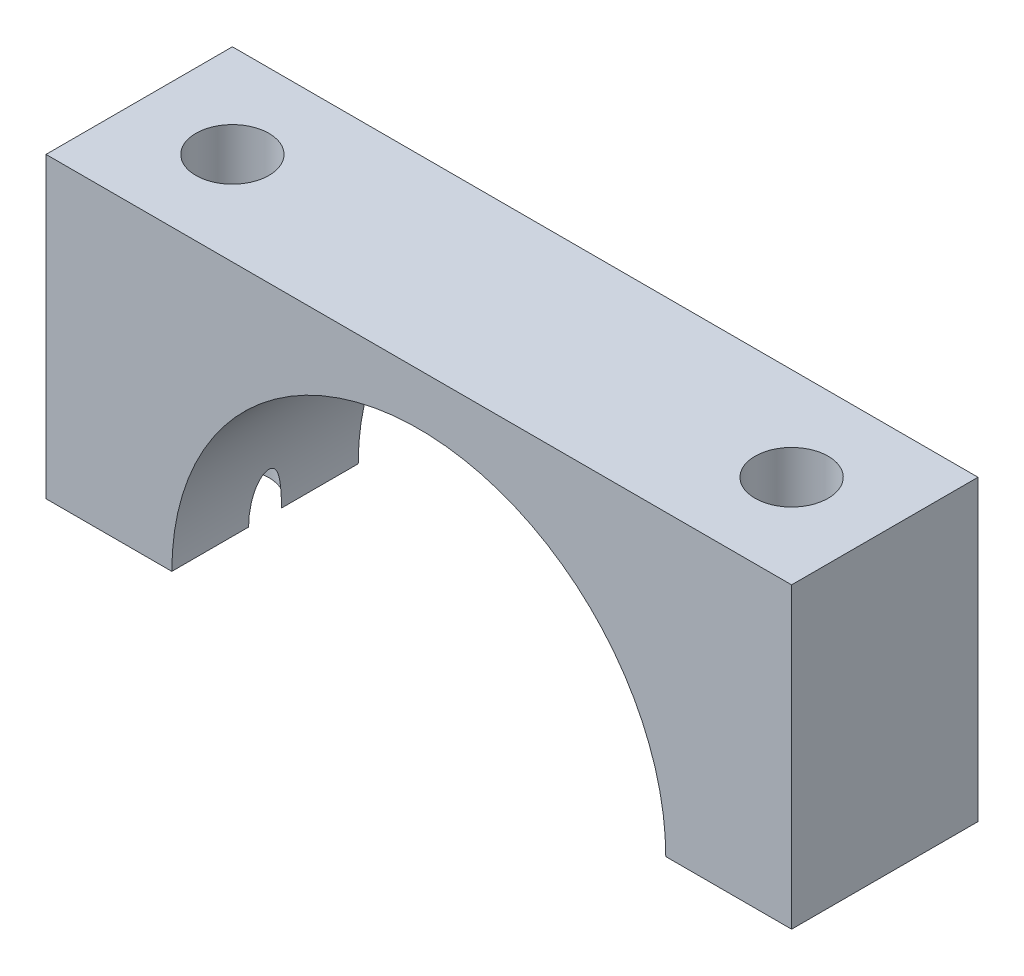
from build123d import *

# Parameters (mm, degrees)
BOSS_EXTRUDE1_DEPTH = 12.7
SKETCH2_R           = 2.4892
CUT_EXTRUDE2_DEPTH  = 57.167894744


with BuildPart() as part:
    # Sketch1 → Boss-Extrude1 (new body)
    with BuildSketch(Plane.XY):
        with BuildLine():
            Line((0, 0), (0, 20.32))
            Line((0, 20.32), (50.8, 20.32))
            Line((50.8, 20.32), (50.8, 0))
            Line((50.8, 0), (42.2275, 0))
            ThreePointArc((42.2275, 0), (25.4, 16.8275), (8.5725, 0))
            Line((8.5725, 0), (0, 0))
        make_face()
    extrude(amount=BOSS_EXTRUDE1_DEPTH)

    # Sketch2 → Cut-Extrude2 (cut, through all)
    with BuildSketch(Plane(origin=(0, 20.32, 0), x_dir=(1, 0, 0), z_dir=(0, 1, 0))):
        with Locations(Location((6.35, -6.35, 0), (0, 0, 180))):
            Circle(SKETCH2_R)
        with Locations(Location((44.45, -6.35, 0), (0, 0, 180))):
            Circle(SKETCH2_R)
    extrude(amount=-CUT_EXTRUDE2_DEPTH, mode=Mode.SUBTRACT)


solid = part.part
